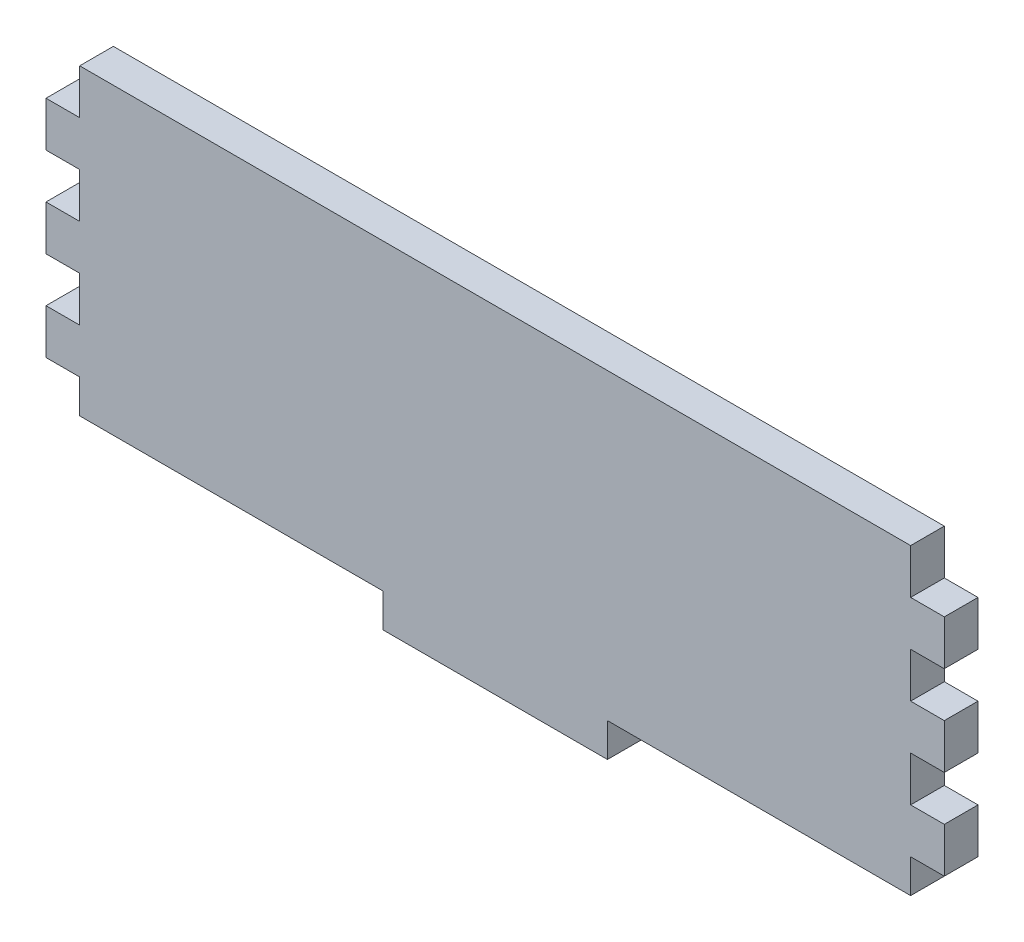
from build123d import *

# Parameters (mm, degrees)
SALIENTE_EXTRUIR1_DEPTH = 15
CROQUIS2_W              = 15
CROQUIS2_H              = 20
CROQUIS2_H_2            = 15
CORTAR_EXTRUIR1_DEPTH   = 215.126131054


with BuildPart() as part:
    # Croquis1 → Saliente-Extruir1 (new body)
    with BuildSketch(Plane.XY):
        Polygon((-200, -60), (-50, -60), (-50, -75), (50, -75), (50, -60), (200, -60), (200, 75), (-200, 75), align=None)
    extrude(amount=SALIENTE_EXTRUIR1_DEPTH)

    # Croquis2 → Cortar-Extruir1 (cut, through all)
    with BuildSketch(Plane.XY.offset(15)):
        with Locations((-192.5, 65)):
            Rectangle(CROQUIS2_W, CROQUIS2_H)
        with Locations((-192.5, 25)):
            Rectangle(CROQUIS2_W, CROQUIS2_H)
        with Locations((-192.5, -15)):
            Rectangle(CROQUIS2_W, CROQUIS2_H)
        with Locations((192.5, -15)):
            Rectangle(CROQUIS2_W, CROQUIS2_H)
        with Locations((192.5, 25)):
            Rectangle(CROQUIS2_W, CROQUIS2_H)
        with Locations((192.5, 65)):
            Rectangle(CROQUIS2_W, CROQUIS2_H)
        with Locations((-192.5, -52.5)):
            Rectangle(CROQUIS2_W, CROQUIS2_H_2)
        with Locations((192.5, -52.5)):
            Rectangle(CROQUIS2_W, CROQUIS2_H_2)
    extrude(amount=-CORTAR_EXTRUIR1_DEPTH, mode=Mode.SUBTRACT)


solid = part.part
